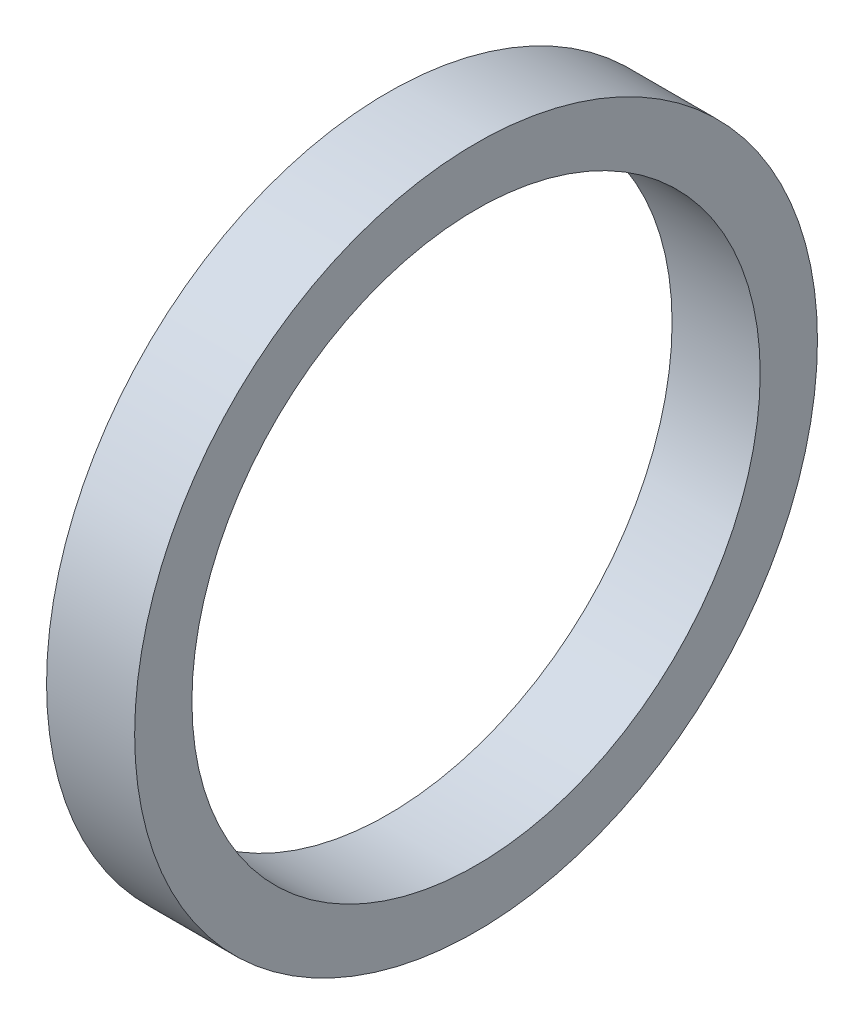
from build123d import *

# Parameters (mm, degrees)
ESQUISSE1_W = 4
ESQUISSE1_H = 2.6


with BuildPart() as part:
    # Esquisse1 → R_volution1 (revolve)
    with BuildSketch(Plane.XY, mode=Mode.PRIVATE) as r_volution1_sk:
        with Locations((2, 14.2)):
            Rectangle(ESQUISSE1_W, ESQUISSE1_H)
    revolve(r_volution1_sk.sketch.rotate(Axis((-17.358445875, 0, 0), (1, 0, 0)), 90), axis=Axis((-17.358445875, 0, 0), (1, 0, 0)))


solid = part.part
